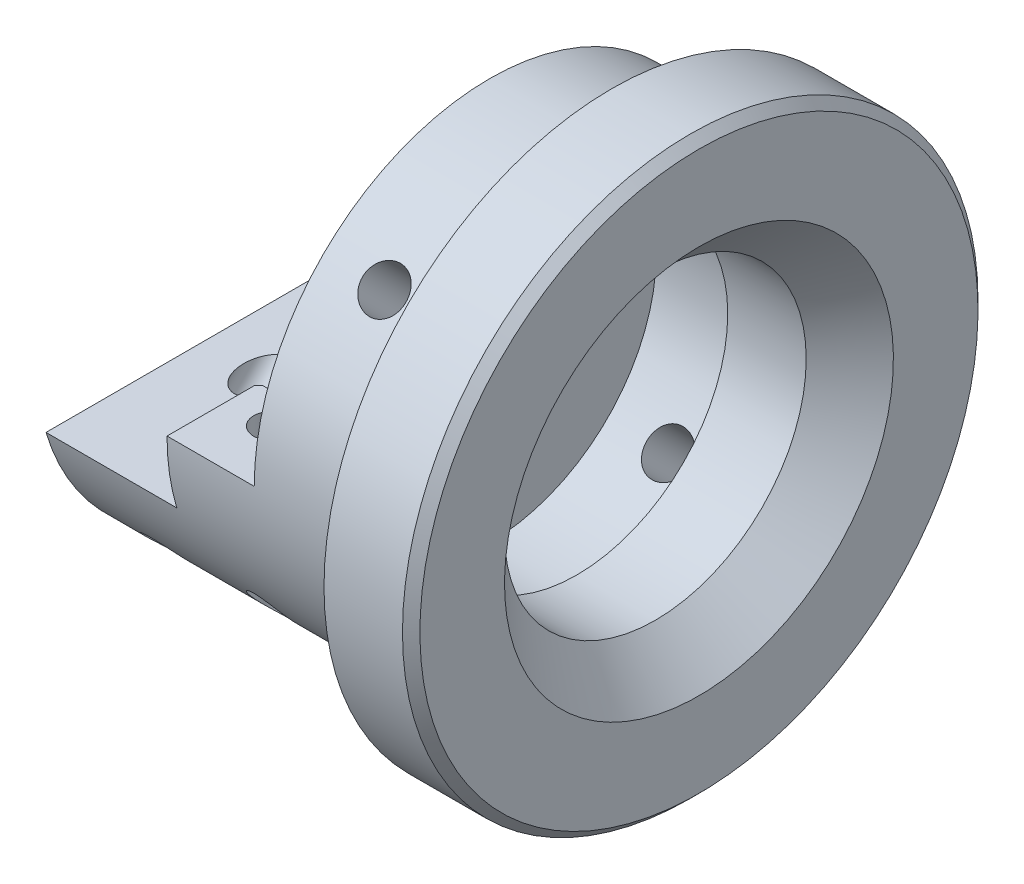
from build123d import *

# Parameters (mm, degrees)
SKIZZE20_W                      = 5
SKIZZE20_H                      = 9.55
SKIZZE2_W                       = 13
SKIZZE2_H                       = 13.5
SCHNITT_LINEAR_AUSTRAGEN1_DEPTH = 25
SKIZZE4_W                       = 8
SKIZZE4_H                       = 3.85
SCHNITT_LINEAR_AUSTRAGEN2_DEPTH = 25
M2_5_GEWINDEBOHRUNG1_D          = 2.05
M3_GEWINDEBOHRUNG5_D            = 2.5
M3_GEWINDEBOHRUNG6_D            = 2.5
FASE1_SIZE                      = 2.5
FASE2_SIZE                      = 0.5
SKIZZE21_R                      = 1.5
SCHNITT_LINEAR_AUSTRAGEN3_DEPTH = 35.197953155
FASE3_SIZE                      = 0.25
SKIZZE22_R                      = 5.5
SCHNITT_LINEAR_AUSTRAGEN4_DEPTH = 35.197953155


with BuildPart() as part:
    # Skizze1 → Rotation1 (revolve)
    with BuildSketch(Plane.XY):
        Polygon((139.7, 16.5), (144.7, 16.5), (144.7, 8.65), (132.7, 8.65), (132.7, 0), (119.7, 0), (119.7, 13.5), (139.7, 13.5), align=None)
    revolve(axis=Axis((132.7, 0, 0), (-1, 0, 0)))

    # Skizze20 → Schnitt-Rotation1 (revolve, cut)
    with BuildSketch(Plane.XY):
        with Locations((135.2, 4.775)):
            Rectangle(SKIZZE20_W, SKIZZE20_H)
    revolve(axis=Axis((137.7, 0, 0), (-1, 0, 0)), mode=Mode.SUBTRACT)

    # Skizze2 → Schnitt-Linear austragen1 (cut, symmetric)
    with BuildSketch(Plane.XY):
        with Locations((126.2, 6.75)):
            Rectangle(SKIZZE2_W, SKIZZE2_H)
    extrude(amount=SCHNITT_LINEAR_AUSTRAGEN1_DEPTH, both=True, mode=Mode.SUBTRACT)

    # Skizze4 → Schnitt-Linear austragen2 (cut, symmetric)
    with BuildSketch(Plane.XY):
        with Locations((123.7, -1.925)):
            Rectangle(SKIZZE4_W, SKIZZE4_H)
    extrude(amount=SCHNITT_LINEAR_AUSTRAGEN2_DEPTH, both=True, mode=Mode.SUBTRACT)

    # M2.5 Gewindebohrung1 (through all)
    with Locations(Plane(origin=(0, 0, 0), x_dir=(-1, 0, 0), z_dir=(0, 1, 0))):
        with Locations((-130.2, 10), (-130.2, -10)):
            Hole(M2_5_GEWINDEBOHRUNG1_D / 2)

    # Skizze7 → M3 Gewindebohrung1 (revolve, cut)
    with BuildSketch(Plane(origin=(136.2, 9.545941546, -9.545941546), x_dir=(0, 0.7071067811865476, 0.7071067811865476), z_dir=(1, 0, 0))):
        Polygon((0, 0), (0, 7.251075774), (1.25, 6.5), (1.25, 0), align=None)
    m3_gewindebohrung1 = revolve(axis=Axis((136.2, 14.036069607, -14.036069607), (0, -0.7071067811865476, 0.7071067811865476)), mode=Mode.SUBTRACT)

    # Spiegeln1: M3 Gewindebohrung1 across plane
    add(m3_gewindebohrung1.mirror(Plane(origin=(0, 0, 0), x_dir=(0, 0.7071067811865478, 0.7071067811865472), z_dir=(0, 0.7071067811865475, -0.7071067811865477))), mode=Mode.SUBTRACT)

    # Skizze11 → M3 Gewindebohrung3 (revolve, cut)
    with BuildSketch(Plane(origin=(136.2, 9.545941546, 9.545941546), x_dir=(0, -0.7071067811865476, 0.7071067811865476), z_dir=(1, 0, 0))):
        Polygon((0, 0), (0, 7.251075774), (1.25, 6.5), (1.25, 0), align=None)
    m3_gewindebohrung3 = revolve(axis=Axis((136.2, 14.036069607, 14.036069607), (0, -0.7071067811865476, -0.7071067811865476)), mode=Mode.SUBTRACT)

    # M3 Gewindebohrung5 (through all)
    with Locations(Plane(origin=(0, -9.545941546, -9.545941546), x_dir=(-1, 0, 0), z_dir=(0, -0.7071067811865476, -0.7071067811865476))):
        with Locations((-123.7, 0)):
            Hole(M3_GEWINDEBOHRUNG5_D / 2)

    # M3 Gewindebohrung6 (through all)
    with Locations(Plane(origin=(0, -9.545941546, 9.545941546), x_dir=(1, 0, 0), z_dir=(0, -0.7071067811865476, 0.7071067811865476))):
        with Locations((123.7, 0)):
            Hole(M3_GEWINDEBOHRUNG6_D / 2)

    # Fase1
    fase1_edges = [part.edges().sort_by_distance(p)[0] for p in [
        (144.7, -8.65, 0),
    ]]
    chamfer(fase1_edges, length=FASE1_SIZE)

    # Fase2
    fase2_edges = [part.edges().sort_by_distance(p)[0] for p in [
        (119.7, -13.5, 0),
        (119.7, -3.85, 0),
        (144.7, -16.5, 0),
    ]]
    chamfer(fase2_edges, length=FASE2_SIZE)

    # Skizze21 → Schnitt-Linear austragen3 (cut, through all)
    with BuildSketch(Plane.ZY.offset(-119.7)):
        with Locations((-6.75, 0)):
            Circle(SKIZZE21_R)
        with Locations((6.75, 0)):
            Circle(SKIZZE21_R)
    extrude(amount=-SCHNITT_LINEAR_AUSTRAGEN3_DEPTH, mode=Mode.SUBTRACT)

    # Fase3
    fase3_edges = [part.edges().sort_by_distance(p)[0] for p in [
        (127.7, -1.5, -6.75),
        (132.7, -1.5, -6.75),
        (127.7, -1.5, 6.75),
        (132.7, -1.5, 6.75),
    ]]
    chamfer(fase3_edges, length=FASE3_SIZE)

    # Spiegeln2: M3 Gewindebohrung3 across plane
    add(m3_gewindebohrung3.mirror(Plane(origin=(0, 0, 0), x_dir=(0, -0.7071067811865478, 0.7071067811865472), z_dir=(0, 0.7071067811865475, 0.7071067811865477))), mode=Mode.SUBTRACT)

    # Skizze22 → Schnitt-Linear austragen4 (cut, through all)
    with BuildSketch(Plane.ZY.offset(-119.7)):
        with Locations((0, 3)):
            Circle(SKIZZE22_R)
    extrude(amount=-SCHNITT_LINEAR_AUSTRAGEN4_DEPTH, mode=Mode.SUBTRACT)


solid = part.part
